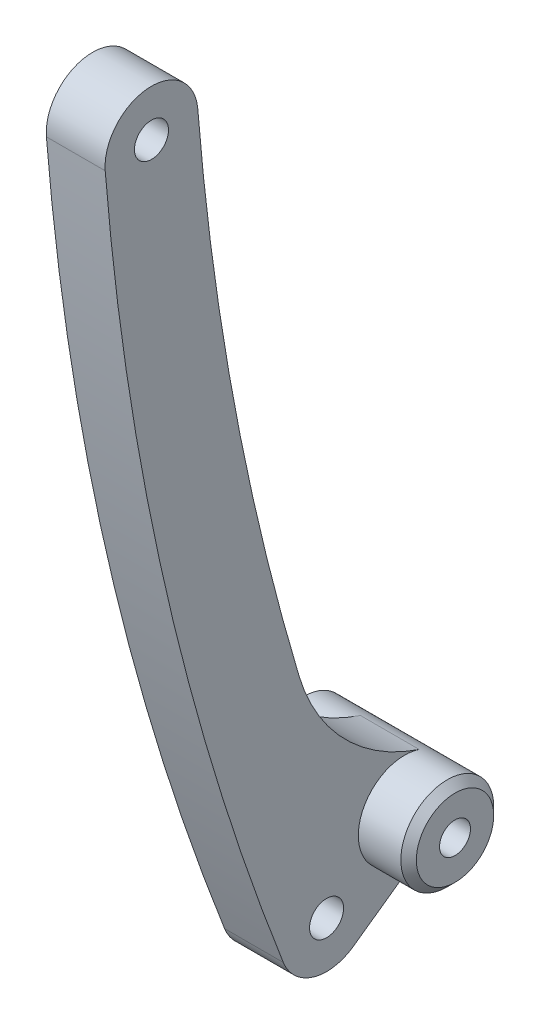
ISO-10303-21;
HEADER;
FILE_DESCRIPTION(('STEP AP214'),'2;1');
FILE_NAME('part.step','',(''),(''),'','','');
FILE_SCHEMA(('AUTOMOTIVE_DESIGN { 1 0 10303 214 1 1 1 1 }'));
ENDSEC;
DATA;
#1=APPLICATION_CONTEXT('core data for automotive mechanical design processes');
#2=APPLICATION_PROTOCOL_DEFINITION('international standard','automotive_design',2000,#1);
#3=PRODUCT_CONTEXT('',#1,'mechanical');
#4=PRODUCT('Part','Part','',(#3));
#5=PRODUCT_RELATED_PRODUCT_CATEGORY('part','',(#4));
#6=PRODUCT_DEFINITION_FORMATION('','',#4);
#7=PRODUCT_DEFINITION_CONTEXT('part definition',#1,'design');
#8=PRODUCT_DEFINITION('design','',#6,#7);
#9=PRODUCT_DEFINITION_SHAPE('','',#8);
#10=(LENGTH_UNIT() NAMED_UNIT(*) SI_UNIT(.MILLI.,.METRE.));
#11=(NAMED_UNIT(*) PLANE_ANGLE_UNIT() SI_UNIT($,.RADIAN.));
#12=(NAMED_UNIT(*) SI_UNIT($,.STERADIAN.) SOLID_ANGLE_UNIT());
#13=UNCERTAINTY_MEASURE_WITH_UNIT(LENGTH_MEASURE(1.E-05),#10,'distance_accuracy_value','');
#14=(GEOMETRIC_REPRESENTATION_CONTEXT(3) GLOBAL_UNCERTAINTY_ASSIGNED_CONTEXT((#13)) GLOBAL_UNIT_ASSIGNED_CONTEXT((#10,
#11,#12)) REPRESENTATION_CONTEXT('',''));
#15=CARTESIAN_POINT('',(0.,0.,0.));
#16=DIRECTION('',(0.,0.,1.));
#17=DIRECTION('',(1.,0.,0.));
#18=AXIS2_PLACEMENT_3D('',#15,#16,#17);
#19=CARTESIAN_POINT('',(-5.15,3.59574231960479,-11.0508055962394));
#20=DIRECTION('',(1.,0.,0.));
#21=DIRECTION('',(0.,0.,-1.));
#22=AXIS2_PLACEMENT_3D('',#19,#20,#21);
#23=CONICAL_SURFACE('',#22,2.5,0.78539816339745);
#24=CARTESIAN_POINT('',(-5.15,3.59574231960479,-11.0508055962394));
#25=DIRECTION('',(-1.,0.,0.));
#26=DIRECTION('',(0.,0.,-1.));
#27=AXIS2_PLACEMENT_3D('',#24,#25,#26);
#28=CIRCLE('',#27,2.5);
#29=CARTESIAN_POINT('',(-5.15,3.59574231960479,-13.5508055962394));
#30=VERTEX_POINT('',#29);
#31=EDGE_CURVE('E131',#30,#30,#28,.T.);
#32=ORIENTED_EDGE('',*,*,#31,.F.);
#33=EDGE_LOOP('',(#32));
#34=FACE_BOUND('',#33,.T.);
#35=CARTESIAN_POINT('',(-4.65,3.59574231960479,-11.0508055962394));
#36=DIRECTION('',(1.,0.,0.));
#37=DIRECTION('',(0.,0.,-1.));
#38=AXIS2_PLACEMENT_3D('',#35,#36,#37);
#39=CIRCLE('',#38,3.);
#40=CARTESIAN_POINT('',(-4.65,3.59574231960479,-14.0508055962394));
#41=VERTEX_POINT('',#40);
#42=EDGE_CURVE('E186',#41,#41,#39,.T.);
#43=ORIENTED_EDGE('',*,*,#42,.F.);
#44=EDGE_LOOP('',(#43));
#45=FACE_BOUND('',#44,.T.);
#46=ADVANCED_FACE('F17',(#34,#45),#23,.T.);
#47=CARTESIAN_POINT('',(4.65,3.59574231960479,-11.0508055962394));
#48=DIRECTION('',(-1.,0.,0.));
#49=DIRECTION('',(0.,0.,1.));
#50=AXIS2_PLACEMENT_3D('',#47,#48,#49);
#51=CONICAL_SURFACE('',#50,3.,0.78539816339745);
#52=CARTESIAN_POINT('',(4.65,3.59574231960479,-11.0508055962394));
#53=DIRECTION('',(-1.,0.,0.));
#54=DIRECTION('',(0.,0.,-1.));
#55=AXIS2_PLACEMENT_3D('',#52,#53,#54);
#56=CIRCLE('',#55,3.);
#57=CARTESIAN_POINT('',(4.65,3.59574231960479,-14.0508055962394));
#58=VERTEX_POINT('',#57);
#59=EDGE_CURVE('E189',#58,#58,#56,.T.);
#60=ORIENTED_EDGE('',*,*,#59,.F.);
#61=EDGE_LOOP('',(#60));
#62=FACE_BOUND('',#61,.T.);
#63=CARTESIAN_POINT('',(5.15,3.59574231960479,-11.0508055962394));
#64=DIRECTION('',(1.,0.,0.));
#65=DIRECTION('',(0.,0.,-1.));
#66=AXIS2_PLACEMENT_3D('',#63,#64,#65);
#67=CIRCLE('',#66,2.5);
#68=CARTESIAN_POINT('',(5.15,3.59574231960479,-13.5508055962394));
#69=VERTEX_POINT('',#68);
#70=EDGE_CURVE('E11',#69,#69,#67,.T.);
#71=ORIENTED_EDGE('',*,*,#70,.F.);
#72=EDGE_LOOP('',(#71));
#73=FACE_BOUND('',#72,.T.);
#74=ADVANCED_FACE('F293',(#62,#73),#51,.T.);
#75=CARTESIAN_POINT('',(5.15,24.608026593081,-2.86788327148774));
#76=DIRECTION('',(1.,0.,0.));
#77=DIRECTION('',(0.,1.,0.));
#78=AXIS2_PLACEMENT_3D('',#75,#76,#77);
#79=PLANE('',#78);
#80=CARTESIAN_POINT('',(5.15,3.59574231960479,-11.0508055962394));
#81=DIRECTION('',(1.,0.,0.));
#82=DIRECTION('',(0.,0.,-1.));
#83=AXIS2_PLACEMENT_3D('',#80,#81,#82);
#84=CIRCLE('',#83,1.);
#85=CARTESIAN_POINT('',(5.15,3.59574231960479,-12.0508055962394));
#86=VERTEX_POINT('',#85);
#87=EDGE_CURVE('E26',#86,#86,#84,.T.);
#88=ORIENTED_EDGE('',*,*,#87,.F.);
#89=EDGE_LOOP('',(#88));
#90=FACE_BOUND('',#89,.T.);
#91=ORIENTED_EDGE('',*,*,#70,.T.);
#92=EDGE_LOOP('',(#91));
#93=FACE_BOUND('',#92,.T.);
#94=ADVANCED_FACE('F298',(#90,#93),#79,.T.);
#95=CARTESIAN_POINT('',(1.9,3.59574231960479,-11.0508055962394));
#96=DIRECTION('',(-1.,0.,0.));
#97=DIRECTION('',(0.,0.,1.));
#98=AXIS2_PLACEMENT_3D('',#95,#96,#97);
#99=CYLINDRICAL_SURFACE('',#98,1.);
#100=ORIENTED_EDGE('',*,*,#87,.T.);
#101=EDGE_LOOP('',(#100));
#102=FACE_BOUND('',#101,.T.);
#103=CARTESIAN_POINT('',(-5.15,3.59574231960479,-11.0508055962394));
#104=DIRECTION('',(1.,0.,0.));
#105=DIRECTION('',(0.,0.,-1.));
#106=AXIS2_PLACEMENT_3D('',#103,#104,#105);
#107=CIRCLE('',#106,1.);
#108=CARTESIAN_POINT('',(-5.15,3.59574231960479,-12.0508055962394));
#109=VERTEX_POINT('',#108);
#110=EDGE_CURVE('E134',#109,#109,#107,.T.);
#111=ORIENTED_EDGE('',*,*,#110,.F.);
#112=EDGE_LOOP('',(#111));
#113=FACE_BOUND('',#112,.T.);
#114=ADVANCED_FACE('F302',(#102,#113),#99,.F.);
#115=CARTESIAN_POINT('',(-5.15,24.6080265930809,-2.86788327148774));
#116=DIRECTION('',(1.,0.,0.));
#117=DIRECTION('',(0.,1.,0.));
#118=AXIS2_PLACEMENT_3D('',#115,#116,#117);
#119=PLANE('',#118);
#120=ORIENTED_EDGE('',*,*,#110,.T.);
#121=EDGE_LOOP('',(#120));
#122=FACE_BOUND('',#121,.T.);
#123=ORIENTED_EDGE('',*,*,#31,.T.);
#124=EDGE_LOOP('',(#123));
#125=FACE_BOUND('',#124,.T.);
#126=ADVANCED_FACE('F19',(#122,#125),#119,.F.);
#127=CARTESIAN_POINT('',(1.9,17.8486562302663,-15.7256793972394));
#128=DIRECTION('',(-1.,0.,0.));
#129=DIRECTION('',(0.,0.,1.));
#130=AXIS2_PLACEMENT_3D('',#127,#128,#129);
#131=CYLINDRICAL_SURFACE('',#130,12.);
#132=CARTESIAN_POINT('',(1.9,17.8486562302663,-15.7256793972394));
#133=DIRECTION('',(-1.,0.,0.));
#134=DIRECTION('',(0.,0.,-1.));
#135=AXIS2_PLACEMENT_3D('',#132,#133,#134);
#136=CIRCLE('',#135,12.);
#137=CARTESIAN_POINT('',(1.9,6.44632510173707,-11.9857803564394));
#138=VERTEX_POINT('',#137);
#139=CARTESIAN_POINT('',(1.9,14.4285387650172,-4.22338412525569));
#140=VERTEX_POINT('',#139);
#141=EDGE_CURVE('E140',#138,#140,#136,.T.);
#142=ORIENTED_EDGE('',*,*,#141,.F.);
#143=DIRECTION('',(1.,0.,0.));
#144=VECTOR('',#143,1.);
#145=CARTESIAN_POINT('',(1.9,6.44632510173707,-11.9857803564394));
#146=LINE('',#145,#144);
#147=CARTESIAN_POINT('',(-1.9,6.44632510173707,-11.9857803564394));
#148=VERTEX_POINT('',#147);
#149=EDGE_CURVE('E178',#148,#138,#146,.T.);
#150=ORIENTED_EDGE('',*,*,#149,.F.);
#151=CARTESIAN_POINT('',(-1.9,17.8486562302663,-15.7256793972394));
#152=DIRECTION('',(1.,0.,0.));
#153=DIRECTION('',(0.,0.,-1.));
#154=AXIS2_PLACEMENT_3D('',#151,#152,#153);
#155=CIRCLE('',#154,12.);
#156=CARTESIAN_POINT('',(-1.9,14.4285387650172,-4.22338412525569));
#157=VERTEX_POINT('',#156);
#158=EDGE_CURVE('E135',#157,#148,#155,.T.);
#159=ORIENTED_EDGE('',*,*,#158,.F.);
#160=DIRECTION('',(-1.,0.,0.));
#161=VECTOR('',#160,1.);
#162=CARTESIAN_POINT('',(1.9,14.4285387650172,-4.22338412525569));
#163=LINE('',#162,#161);
#164=EDGE_CURVE('E170',#140,#157,#163,.T.);
#165=ORIENTED_EDGE('',*,*,#164,.F.);
#166=EDGE_LOOP('',(#142,#150,#159,#165));
#167=FACE_BOUND('',#166,.T.);
#168=ADVANCED_FACE('F249',(#167),#131,.F.);
#169=CARTESIAN_POINT('',(-1.9,24.6080265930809,-2.86788327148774));
#170=DIRECTION('',(1.,0.,0.));
#171=DIRECTION('',(0.,1.,0.));
#172=AXIS2_PLACEMENT_3D('',#169,#170,#171);
#173=PLANE('',#172);
#174=CARTESIAN_POINT('',(-1.9,0.,-6.));
#175=DIRECTION('',(1.,0.,0.));
#176=DIRECTION('',(0.,0.,-1.));
#177=AXIS2_PLACEMENT_3D('',#174,#175,#176);
#178=CIRCLE('',#177,1.1);
#179=CARTESIAN_POINT('',(-1.9,0.,-7.1));
#180=VERTEX_POINT('',#179);
#181=EDGE_CURVE('E145',#180,#180,#178,.T.);
#182=ORIENTED_EDGE('',*,*,#181,.T.);
#183=EDGE_LOOP('',(#182));
#184=FACE_BOUND('',#183,.T.);
#185=ORIENTED_EDGE('',*,*,#158,.T.);
#186=CARTESIAN_POINT('',(-1.9,3.59574231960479,-11.0508055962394));
#187=DIRECTION('',(1.,0.,0.));
#188=DIRECTION('',(0.,0.,-1.));
#189=AXIS2_PLACEMENT_3D('',#186,#187,#188);
#190=CIRCLE('',#189,3.);
#191=CARTESIAN_POINT('',(-1.9,1.15180412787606,-12.7906809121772));
#192=VERTEX_POINT('',#191);
#193=EDGE_CURVE('E182',#148,#192,#190,.T.);
#194=ORIENTED_EDGE('',*,*,#193,.T.);
#195=DIRECTION('',(0.,0.579958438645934,-0.814646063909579));
#196=VECTOR('',#195,1.);
#197=CARTESIAN_POINT('',(-1.9,-0.646067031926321,-10.2652781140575));
#198=LINE('',#197,#196);
#199=CARTESIAN_POINT('',(-1.9,-2.44393819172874,-7.73987531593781));
#200=VERTEX_POINT('',#199);
#201=EDGE_CURVE('E192',#200,#192,#198,.T.);
#202=ORIENTED_EDGE('',*,*,#201,.F.);
#203=CARTESIAN_POINT('',(-1.9,0.,-6.));
#204=DIRECTION('',(-1.,0.,0.));
#205=DIRECTION('',(0.,0.,-1.));
#206=AXIS2_PLACEMENT_3D('',#203,#204,#205);
#207=CIRCLE('',#206,3.);
#208=CARTESIAN_POINT('',(-1.9,-1.08867459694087,-3.20450583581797));
#209=VERTEX_POINT('',#208);
#210=EDGE_CURVE('E206',#200,#209,#207,.T.);
#211=ORIENTED_EDGE('',*,*,#210,.T.);
#212=CARTESIAN_POINT('',(-1.9,63.2460368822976,-168.402914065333));
#213=DIRECTION('',(1.,0.,0.));
#214=DIRECTION('',(0.,0.,-1.));
#215=AXIS2_PLACEMENT_3D('',#212,#213,#214);
#216=CIRCLE('',#215,177.283584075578);
#217=CARTESIAN_POINT('',(-1.9,48.9745505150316,8.30530266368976));
#218=VERTEX_POINT('',#217);
#219=EDGE_CURVE('E226',#218,#209,#216,.T.);
#220=ORIENTED_EDGE('',*,*,#219,.F.);
#221=CARTESIAN_POINT('',(-1.9,49.2160531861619,5.31503905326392));
#222=DIRECTION('',(-1.,0.,0.));
#223=DIRECTION('',(0.,0.,-1.));
#224=AXIS2_PLACEMENT_3D('',#221,#222,#223);
#225=CIRCLE('',#224,3.);
#226=CARTESIAN_POINT('',(-1.9,49.4575558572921,2.32477544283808));
#227=VERTEX_POINT('',#226);
#228=EDGE_CURVE('E160',#218,#227,#225,.T.);
#229=ORIENTED_EDGE('',*,*,#228,.T.);
#230=CARTESIAN_POINT('',(-1.9,63.2460368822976,-168.402914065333));
#231=DIRECTION('',(1.,0.,0.));
#232=DIRECTION('',(0.,0.,-1.));
#233=AXIS2_PLACEMENT_3D('',#230,#231,#232);
#234=CIRCLE('',#233,171.283584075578);
#235=EDGE_CURVE('E169',#227,#157,#234,.T.);
#236=ORIENTED_EDGE('',*,*,#235,.T.);
#237=EDGE_LOOP('',(#185,#194,#202,#211,#220,#229,#236));
#238=FACE_BOUND('',#237,.T.);
#239=CARTESIAN_POINT('',(-1.9,49.2160531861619,5.31503905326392));
#240=DIRECTION('',(1.,0.,0.));
#241=DIRECTION('',(0.,0.,-1.));
#242=AXIS2_PLACEMENT_3D('',#239,#240,#241);
#243=CIRCLE('',#242,1.1);
#244=CARTESIAN_POINT('',(-1.9,49.2160531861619,4.21503905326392));
#245=VERTEX_POINT('',#244);
#246=EDGE_CURVE('E151',#245,#245,#243,.T.);
#247=ORIENTED_EDGE('',*,*,#246,.T.);
#248=EDGE_LOOP('',(#247));
#249=FACE_BOUND('',#248,.T.);
#250=ADVANCED_FACE('F268',(#184,#238,#249),#173,.F.);
#251=CARTESIAN_POINT('',(1.9,24.6080265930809,-2.86788327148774));
#252=DIRECTION('',(1.,0.,0.));
#253=DIRECTION('',(0.,1.,0.));
#254=AXIS2_PLACEMENT_3D('',#251,#252,#253);
#255=PLANE('',#254);
#256=CARTESIAN_POINT('',(1.9,0.,-6.));
#257=DIRECTION('',(1.,0.,0.));
#258=DIRECTION('',(0.,0.,-1.));
#259=AXIS2_PLACEMENT_3D('',#256,#257,#258);
#260=CIRCLE('',#259,1.1);
#261=CARTESIAN_POINT('',(1.9,0.,-7.1));
#262=VERTEX_POINT('',#261);
#263=EDGE_CURVE('E148',#262,#262,#260,.T.);
#264=ORIENTED_EDGE('',*,*,#263,.F.);
#265=EDGE_LOOP('',(#264));
#266=FACE_BOUND('',#265,.T.);
#267=CARTESIAN_POINT('',(1.9,49.2160531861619,5.31503905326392));
#268=DIRECTION('',(1.,0.,0.));
#269=DIRECTION('',(0.,0.,-1.));
#270=AXIS2_PLACEMENT_3D('',#267,#268,#269);
#271=CIRCLE('',#270,1.1);
#272=CARTESIAN_POINT('',(1.9,49.2160531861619,4.21503905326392));
#273=VERTEX_POINT('',#272);
#274=EDGE_CURVE('E154',#273,#273,#271,.T.);
#275=ORIENTED_EDGE('',*,*,#274,.F.);
#276=EDGE_LOOP('',(#275));
#277=FACE_BOUND('',#276,.T.);
#278=CARTESIAN_POINT('',(1.9,3.59574231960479,-11.0508055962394));
#279=DIRECTION('',(1.,0.,0.));
#280=DIRECTION('',(0.,0.,-1.));
#281=AXIS2_PLACEMENT_3D('',#278,#279,#280);
#282=CIRCLE('',#281,3.);
#283=CARTESIAN_POINT('',(1.9,1.15180412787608,-12.7906809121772));
#284=VERTEX_POINT('',#283);
#285=EDGE_CURVE('E175',#138,#284,#282,.T.);
#286=ORIENTED_EDGE('',*,*,#285,.F.);
#287=ORIENTED_EDGE('',*,*,#141,.T.);
#288=CARTESIAN_POINT('',(1.9,63.2460368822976,-168.402914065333));
#289=DIRECTION('',(1.,0.,0.));
#290=DIRECTION('',(0.,0.,-1.));
#291=AXIS2_PLACEMENT_3D('',#288,#289,#290);
#292=CIRCLE('',#291,171.283584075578);
#293=CARTESIAN_POINT('',(1.9,49.4575558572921,2.32477544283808));
#294=VERTEX_POINT('',#293);
#295=EDGE_CURVE('E174',#294,#140,#292,.T.);
#296=ORIENTED_EDGE('',*,*,#295,.F.);
#297=CARTESIAN_POINT('',(1.9,49.2160531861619,5.31503905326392));
#298=DIRECTION('',(-1.,0.,0.));
#299=DIRECTION('',(0.,0.,-1.));
#300=AXIS2_PLACEMENT_3D('',#297,#298,#299);
#301=CIRCLE('',#300,3.);
#302=CARTESIAN_POINT('',(1.9,48.9745505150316,8.30530266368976));
#303=VERTEX_POINT('',#302);
#304=EDGE_CURVE('E157',#303,#294,#301,.T.);
#305=ORIENTED_EDGE('',*,*,#304,.F.);
#306=CARTESIAN_POINT('',(1.9,63.2460368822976,-168.402914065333));
#307=DIRECTION('',(1.,0.,0.));
#308=DIRECTION('',(0.,0.,-1.));
#309=AXIS2_PLACEMENT_3D('',#306,#307,#308);
#310=CIRCLE('',#309,177.283584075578);
#311=CARTESIAN_POINT('',(1.9,-1.08867459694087,-3.20450583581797));
#312=VERTEX_POINT('',#311);
#313=EDGE_CURVE('E214',#303,#312,#310,.T.);
#314=ORIENTED_EDGE('',*,*,#313,.T.);
#315=CARTESIAN_POINT('',(1.9,0.,-6.));
#316=DIRECTION('',(-1.,0.,0.));
#317=DIRECTION('',(0.,0.,-1.));
#318=AXIS2_PLACEMENT_3D('',#315,#316,#317);
#319=CIRCLE('',#318,3.);
#320=CARTESIAN_POINT('',(1.9,-2.44393819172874,-7.73987531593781));
#321=VERTEX_POINT('',#320);
#322=EDGE_CURVE('E197',#321,#312,#319,.T.);
#323=ORIENTED_EDGE('',*,*,#322,.F.);
#324=DIRECTION('',(0.,0.579958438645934,-0.814646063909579));
#325=VECTOR('',#324,1.);
#326=CARTESIAN_POINT('',(1.9,-0.646067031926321,-10.2652781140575));
#327=LINE('',#326,#325);
#328=EDGE_CURVE('E201',#321,#284,#327,.T.);
#329=ORIENTED_EDGE('',*,*,#328,.T.);
#330=EDGE_LOOP('',(#286,#287,#296,#305,#314,#323,#329));
#331=FACE_BOUND('',#330,.T.);
#332=ADVANCED_FACE('F239',(#266,#277,#331),#255,.T.);
#333=CARTESIAN_POINT('',(1.9,0.,-6.));
#334=DIRECTION('',(-1.,0.,0.));
#335=DIRECTION('',(0.,0.,1.));
#336=AXIS2_PLACEMENT_3D('',#333,#334,#335);
#337=CYLINDRICAL_SURFACE('',#336,1.1);
#338=ORIENTED_EDGE('',*,*,#181,.F.);
#339=EDGE_LOOP('',(#338));
#340=FACE_BOUND('',#339,.T.);
#341=ORIENTED_EDGE('',*,*,#263,.T.);
#342=EDGE_LOOP('',(#341));
#343=FACE_BOUND('',#342,.T.);
#344=ADVANCED_FACE('F278',(#340,#343),#337,.F.);
#345=CARTESIAN_POINT('',(1.9,49.2160531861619,5.31503905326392));
#346=DIRECTION('',(-1.,0.,0.));
#347=DIRECTION('',(0.,0.,1.));
#348=AXIS2_PLACEMENT_3D('',#345,#346,#347);
#349=CYLINDRICAL_SURFACE('',#348,1.1);
#350=ORIENTED_EDGE('',*,*,#246,.F.);
#351=EDGE_LOOP('',(#350));
#352=FACE_BOUND('',#351,.T.);
#353=ORIENTED_EDGE('',*,*,#274,.T.);
#354=EDGE_LOOP('',(#353));
#355=FACE_BOUND('',#354,.T.);
#356=ADVANCED_FACE('F275',(#352,#355),#349,.F.);
#357=CARTESIAN_POINT('',(1.9,49.2160531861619,5.31503905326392));
#358=DIRECTION('',(-1.,0.,0.));
#359=DIRECTION('',(0.,0.,1.));
#360=AXIS2_PLACEMENT_3D('',#357,#358,#359);
#361=CYLINDRICAL_SURFACE('',#360,3.);
#362=ORIENTED_EDGE('',*,*,#228,.F.);
#363=DIRECTION('',(-1.,0.,0.));
#364=VECTOR('',#363,1.);
#365=CARTESIAN_POINT('',(1.9,48.9745505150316,8.30530266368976));
#366=LINE('',#365,#364);
#367=EDGE_CURVE('E210',#303,#218,#366,.T.);
#368=ORIENTED_EDGE('',*,*,#367,.F.);
#369=ORIENTED_EDGE('',*,*,#304,.T.);
#370=DIRECTION('',(-1.,0.,0.));
#371=VECTOR('',#370,1.);
#372=CARTESIAN_POINT('',(1.9,49.4575558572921,2.32477544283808));
#373=LINE('',#372,#371);
#374=EDGE_CURVE('E163',#294,#227,#373,.T.);
#375=ORIENTED_EDGE('',*,*,#374,.T.);
#376=EDGE_LOOP('',(#362,#368,#369,#375));
#377=FACE_BOUND('',#376,.T.);
#378=ADVANCED_FACE('F258',(#377),#361,.T.);
#379=CARTESIAN_POINT('',(1.9,63.2460368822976,-168.402914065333));
#380=DIRECTION('',(-1.,0.,0.));
#381=DIRECTION('',(0.,0.,1.));
#382=AXIS2_PLACEMENT_3D('',#379,#380,#381);
#383=CYLINDRICAL_SURFACE('',#382,171.283584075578);
#384=ORIENTED_EDGE('',*,*,#295,.T.);
#385=ORIENTED_EDGE('',*,*,#164,.T.);
#386=ORIENTED_EDGE('',*,*,#235,.F.);
#387=ORIENTED_EDGE('',*,*,#374,.F.);
#388=EDGE_LOOP('',(#384,#385,#386,#387));
#389=FACE_BOUND('',#388,.T.);
#390=ADVANCED_FACE('F255',(#389),#383,.F.);
#391=CARTESIAN_POINT('',(1.9,3.59574231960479,-11.0508055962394));
#392=DIRECTION('',(-1.,0.,0.));
#393=DIRECTION('',(0.,0.,1.));
#394=AXIS2_PLACEMENT_3D('',#391,#392,#393);
#395=CYLINDRICAL_SURFACE('',#394,3.);
#396=DIRECTION('',(-1.,0.,0.));
#397=VECTOR('',#396,1.);
#398=CARTESIAN_POINT('',(1.9,1.15180412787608,-12.7906809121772));
#399=LINE('',#398,#397);
#400=EDGE_CURVE('E196',#284,#192,#399,.T.);
#401=ORIENTED_EDGE('',*,*,#400,.T.);
#402=ORIENTED_EDGE('',*,*,#193,.F.);
#403=ORIENTED_EDGE('',*,*,#149,.T.);
#404=ORIENTED_EDGE('',*,*,#285,.T.);
#405=EDGE_LOOP('',(#401,#402,#403,#404));
#406=FACE_BOUND('',#405,.T.);
#407=ORIENTED_EDGE('',*,*,#42,.T.);
#408=EDGE_LOOP('',(#407));
#409=FACE_BOUND('',#408,.T.);
#410=ORIENTED_EDGE('',*,*,#59,.T.);
#411=EDGE_LOOP('',(#410));
#412=FACE_BOUND('',#411,.T.);
#413=ADVANCED_FACE('F245',(#406,#409,#412),#395,.T.);
#414=CARTESIAN_POINT('',(1.9,-0.646067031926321,-10.2652781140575));
#415=DIRECTION('',(0.,0.814646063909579,0.579958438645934));
#416=DIRECTION('',(1.,0.,0.));
#417=AXIS2_PLACEMENT_3D('',#414,#415,#416);
#418=PLANE('',#417);
#419=ORIENTED_EDGE('',*,*,#201,.T.);
#420=ORIENTED_EDGE('',*,*,#400,.F.);
#421=ORIENTED_EDGE('',*,*,#328,.F.);
#422=DIRECTION('',(-1.,0.,0.));
#423=VECTOR('',#422,1.);
#424=CARTESIAN_POINT('',(1.9,-2.44393819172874,-7.73987531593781));
#425=LINE('',#424,#423);
#426=EDGE_CURVE('E202',#321,#200,#425,.T.);
#427=ORIENTED_EDGE('',*,*,#426,.T.);
#428=EDGE_LOOP('',(#419,#420,#421,#427));
#429=FACE_BOUND('',#428,.T.);
#430=ADVANCED_FACE('F242',(#429),#418,.F.);
#431=CARTESIAN_POINT('',(1.9,0.,-6.));
#432=DIRECTION('',(-1.,0.,0.));
#433=DIRECTION('',(0.,0.,1.));
#434=AXIS2_PLACEMENT_3D('',#431,#432,#433);
#435=CYLINDRICAL_SURFACE('',#434,3.);
#436=ORIENTED_EDGE('',*,*,#210,.F.);
#437=ORIENTED_EDGE('',*,*,#426,.F.);
#438=ORIENTED_EDGE('',*,*,#322,.T.);
#439=DIRECTION('',(-1.,0.,0.));
#440=VECTOR('',#439,1.);
#441=CARTESIAN_POINT('',(1.9,-1.08867459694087,-3.20450583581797));
#442=LINE('',#441,#440);
#443=EDGE_CURVE('E222',#312,#209,#442,.T.);
#444=ORIENTED_EDGE('',*,*,#443,.T.);
#445=EDGE_LOOP('',(#436,#437,#438,#444));
#446=FACE_BOUND('',#445,.T.);
#447=ADVANCED_FACE('F266',(#446),#435,.T.);
#448=CARTESIAN_POINT('',(1.9,63.2460368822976,-168.402914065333));
#449=DIRECTION('',(-1.,0.,0.));
#450=DIRECTION('',(0.,0.,1.));
#451=AXIS2_PLACEMENT_3D('',#448,#449,#450);
#452=CYLINDRICAL_SURFACE('',#451,177.283584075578);
#453=ORIENTED_EDGE('',*,*,#219,.T.);
#454=ORIENTED_EDGE('',*,*,#443,.F.);
#455=ORIENTED_EDGE('',*,*,#313,.F.);
#456=ORIENTED_EDGE('',*,*,#367,.T.);
#457=EDGE_LOOP('',(#453,#454,#455,#456));
#458=FACE_BOUND('',#457,.T.);
#459=ADVANCED_FACE('F263',(#458),#452,.T.);
#460=CLOSED_SHELL('',(#46,#74,#94,#114,#126,#168,#250,#332,#344,#356,#378,#390,#413,#430,#447,#459));
#461=MANIFOLD_SOLID_BREP('B1',#460);
#462=ADVANCED_BREP_SHAPE_REPRESENTATION('',(#18,#461),#14);
#463=SHAPE_DEFINITION_REPRESENTATION(#9,#462);
ENDSEC;
END-ISO-10303-21;
